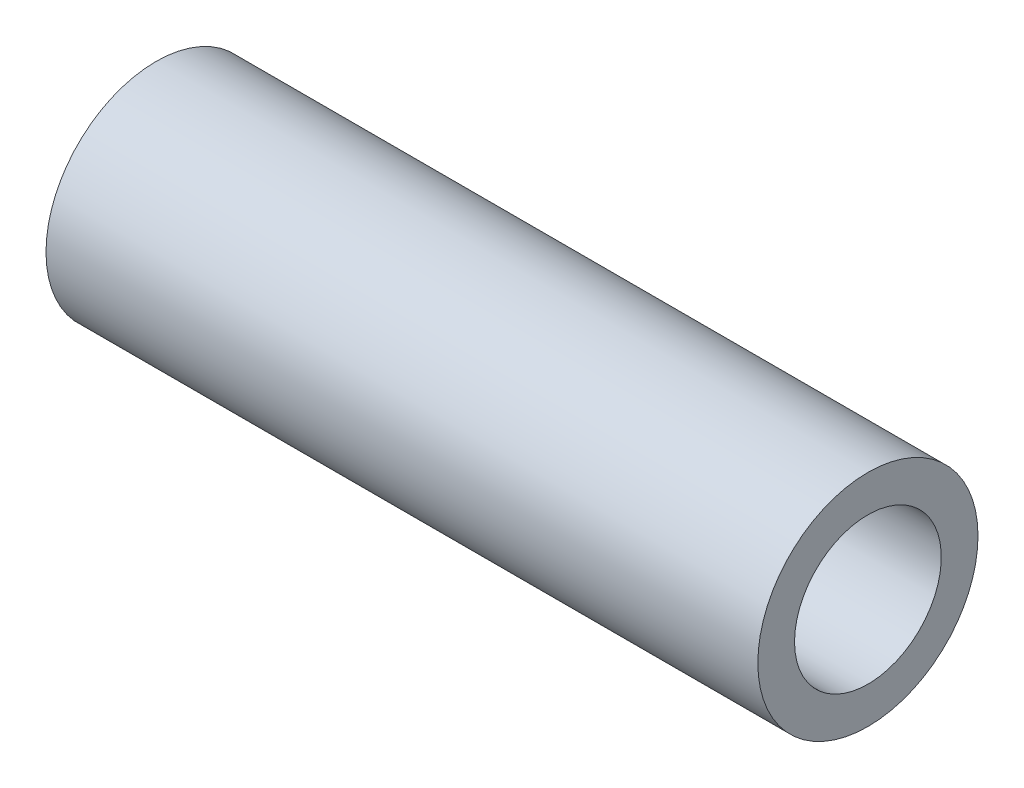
from build123d import *

# Parameters (mm, degrees)
SCHIZZO1_W = 48.5
SCHIZZO1_H = 2.5


with BuildPart() as part:
    # Schizzo1 → Rivoluzione1 (revolve)
    with BuildSketch(Plane.XY, mode=Mode.PRIVATE) as rivoluzione1_sk:
        with Locations((5.869823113, 6.25)):
            Rectangle(SCHIZZO1_W, SCHIZZO1_H)
    revolve(rivoluzione1_sk.sketch.rotate(Axis((-25.572018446, 0, 0), (1, 0, 0)), 90), axis=Axis((-25.572018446, 0, 0), (1, 0, 0)))


solid = part.part
